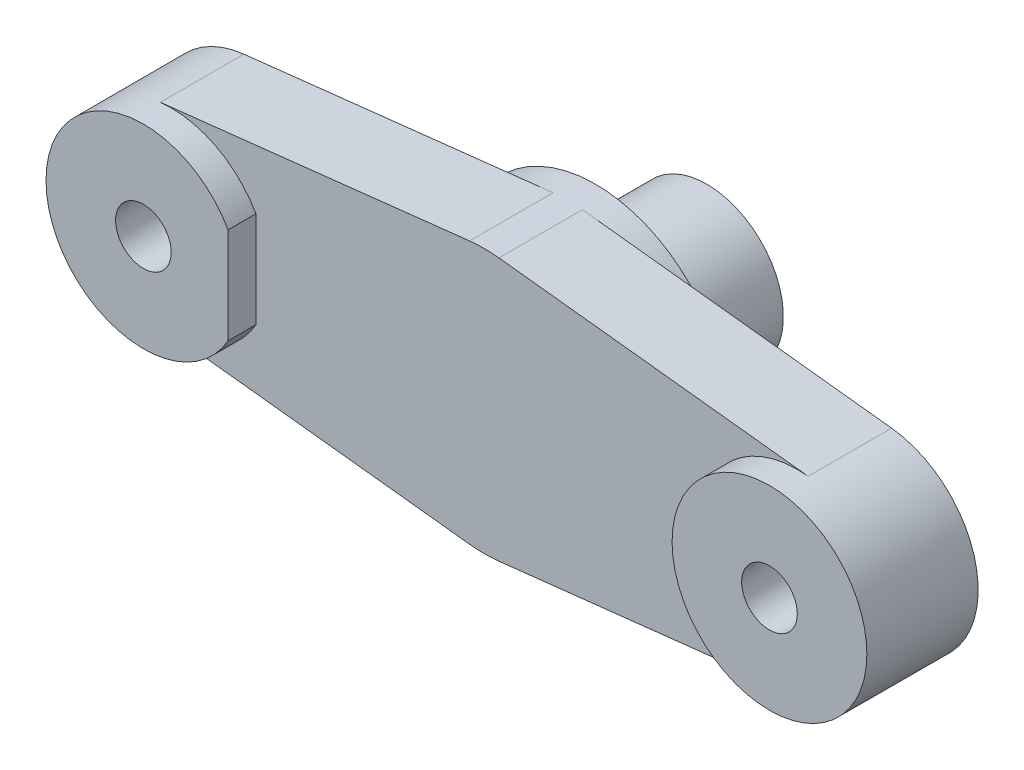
ISO-10303-21;
HEADER;
FILE_DESCRIPTION(('STEP AP214'),'2;1');
FILE_NAME('part.step','',(''),(''),'','','');
FILE_SCHEMA(('AUTOMOTIVE_DESIGN { 1 0 10303 214 1 1 1 1 }'));
ENDSEC;
DATA;
#1=APPLICATION_CONTEXT('core data for automotive mechanical design processes');
#2=APPLICATION_PROTOCOL_DEFINITION('international standard','automotive_design',2000,#1);
#3=PRODUCT_CONTEXT('',#1,'mechanical');
#4=PRODUCT('Part','Part','',(#3));
#5=PRODUCT_RELATED_PRODUCT_CATEGORY('part','',(#4));
#6=PRODUCT_DEFINITION_FORMATION('','',#4);
#7=PRODUCT_DEFINITION_CONTEXT('part definition',#1,'design');
#8=PRODUCT_DEFINITION('design','',#6,#7);
#9=PRODUCT_DEFINITION_SHAPE('','',#8);
#10=(LENGTH_UNIT() NAMED_UNIT(*) SI_UNIT(.MILLI.,.METRE.));
#11=(NAMED_UNIT(*) PLANE_ANGLE_UNIT() SI_UNIT($,.RADIAN.));
#12=(NAMED_UNIT(*) SI_UNIT($,.STERADIAN.) SOLID_ANGLE_UNIT());
#13=UNCERTAINTY_MEASURE_WITH_UNIT(LENGTH_MEASURE(1.E-05),#10,'distance_accuracy_value','');
#14=(GEOMETRIC_REPRESENTATION_CONTEXT(3) GLOBAL_UNCERTAINTY_ASSIGNED_CONTEXT((#13)) GLOBAL_UNIT_ASSIGNED_CONTEXT((#10,
#11,#12)) REPRESENTATION_CONTEXT('',''));
#15=CARTESIAN_POINT('',(0.,0.,0.));
#16=DIRECTION('',(0.,0.,1.));
#17=DIRECTION('',(1.,0.,0.));
#18=AXIS2_PLACEMENT_3D('',#15,#16,#17);
#19=CARTESIAN_POINT('',(-45.,0.,-20.));
#20=DIRECTION('',(0.,0.,1.));
#21=DIRECTION('',(1.,0.,0.));
#22=AXIS2_PLACEMENT_3D('',#19,#20,#21);
#23=CYLINDRICAL_SURFACE('',#22,4.00000000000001);
#24=CARTESIAN_POINT('',(-45.,0.,16.));
#25=DIRECTION('',(0.,0.,1.));
#26=DIRECTION('',(1.,0.,0.));
#27=AXIS2_PLACEMENT_3D('',#24,#25,#26);
#28=CIRCLE('',#27,4.00000000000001);
#29=CARTESIAN_POINT('',(-41.,0.,16.));
#30=VERTEX_POINT('',#29);
#31=EDGE_CURVE('E180',#30,#30,#28,.T.);
#32=ORIENTED_EDGE('',*,*,#31,.T.);
#33=EDGE_LOOP('',(#32));
#34=FACE_BOUND('',#33,.T.);
#35=CARTESIAN_POINT('',(-45.,0.,8.00000000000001));
#36=DIRECTION('',(0.,0.,-1.));
#37=DIRECTION('',(-1.,0.,0.));
#38=AXIS2_PLACEMENT_3D('',#35,#36,#37);
#39=CIRCLE('',#38,4.00000000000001);
#40=CARTESIAN_POINT('',(-49.,0.,8.00000000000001));
#41=VERTEX_POINT('',#40);
#42=EDGE_CURVE('E34',#41,#41,#39,.F.);
#43=ORIENTED_EDGE('',*,*,#42,.F.);
#44=EDGE_LOOP('',(#43));
#45=FACE_BOUND('',#44,.T.);
#46=ADVANCED_FACE('F30',(#34,#45),#23,.F.);
#47=CARTESIAN_POINT('',(45.,0.,-20.));
#48=DIRECTION('',(0.,0.,1.));
#49=DIRECTION('',(1.,0.,0.));
#50=AXIS2_PLACEMENT_3D('',#47,#48,#49);
#51=CYLINDRICAL_SURFACE('',#50,4.00000000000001);
#52=CARTESIAN_POINT('',(45.,0.,16.));
#53=DIRECTION('',(0.,0.,1.));
#54=DIRECTION('',(1.,0.,0.));
#55=AXIS2_PLACEMENT_3D('',#52,#53,#54);
#56=CIRCLE('',#55,4.00000000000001);
#57=CARTESIAN_POINT('',(49.,0.,16.));
#58=VERTEX_POINT('',#57);
#59=EDGE_CURVE('E175',#58,#58,#56,.T.);
#60=ORIENTED_EDGE('',*,*,#59,.T.);
#61=EDGE_LOOP('',(#60));
#62=FACE_BOUND('',#61,.T.);
#63=CARTESIAN_POINT('',(45.,0.,8.00000000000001));
#64=DIRECTION('',(0.,0.,-1.));
#65=DIRECTION('',(-1.,0.,0.));
#66=AXIS2_PLACEMENT_3D('',#63,#64,#65);
#67=CIRCLE('',#66,4.00000000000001);
#68=CARTESIAN_POINT('',(41.,0.,8.00000000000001));
#69=VERTEX_POINT('',#68);
#70=EDGE_CURVE('E173',#69,#69,#67,.F.);
#71=ORIENTED_EDGE('',*,*,#70,.F.);
#72=EDGE_LOOP('',(#71));
#73=FACE_BOUND('',#72,.T.);
#74=ADVANCED_FACE('F284',(#62,#73),#51,.F.);
#75=CARTESIAN_POINT('',(0.,0.,-4.));
#76=DIRECTION('',(0.,0.,-1.));
#77=DIRECTION('',(-1.,0.,0.));
#78=AXIS2_PLACEMENT_3D('',#75,#76,#77);
#79=PLANE('',#78);
#80=CARTESIAN_POINT('',(0.,0.,-4.));
#81=DIRECTION('',(0.,0.,-1.));
#82=DIRECTION('',(-1.,0.,0.));
#83=AXIS2_PLACEMENT_3D('',#80,#81,#82);
#84=CIRCLE('',#83,19.);
#85=CARTESIAN_POINT('',(-19.,0.,-4.));
#86=VERTEX_POINT('',#85);
#87=EDGE_CURVE('E199',#86,#86,#84,.T.);
#88=ORIENTED_EDGE('',*,*,#87,.T.);
#89=EDGE_LOOP('',(#88));
#90=FACE_BOUND('',#89,.T.);
#91=CARTESIAN_POINT('',(0.,0.,-4.));
#92=DIRECTION('',(0.,0.,-1.));
#93=DIRECTION('',(-1.,0.,0.));
#94=AXIS2_PLACEMENT_3D('',#91,#92,#93);
#95=CIRCLE('',#94,11.);
#96=CARTESIAN_POINT('',(-11.,0.,-4.));
#97=VERTEX_POINT('',#96);
#98=EDGE_CURVE('E193',#97,#97,#95,.T.);
#99=ORIENTED_EDGE('',*,*,#98,.F.);
#100=EDGE_LOOP('',(#99));
#101=FACE_BOUND('',#100,.T.);
#102=ADVANCED_FACE('F290',(#90,#101),#79,.T.);
#103=CARTESIAN_POINT('',(0.,0.,0.));
#104=DIRECTION('',(0.,0.,1.));
#105=DIRECTION('',(1.,0.,0.));
#106=AXIS2_PLACEMENT_3D('',#103,#104,#105);
#107=PLANE('',#106);
#108=CARTESIAN_POINT('',(45.,0.,0.));
#109=DIRECTION('',(0.,0.,-1.));
#110=DIRECTION('',(-1.,0.,0.));
#111=AXIS2_PLACEMENT_3D('',#108,#109,#110);
#112=CIRCLE('',#111,7.5);
#113=CARTESIAN_POINT('',(37.5,0.,0.));
#114=VERTEX_POINT('',#113);
#115=EDGE_CURVE('E183',#114,#114,#112,.T.);
#116=ORIENTED_EDGE('',*,*,#115,.F.);
#117=EDGE_LOOP('',(#116));
#118=FACE_BOUND('',#117,.T.);
#119=CARTESIAN_POINT('',(0.,0.,0.));
#120=DIRECTION('',(0.,0.,-1.));
#121=DIRECTION('',(-1.,0.,0.));
#122=AXIS2_PLACEMENT_3D('',#119,#120,#121);
#123=CIRCLE('',#122,19.);
#124=CARTESIAN_POINT('',(2.11111111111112,18.8823518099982,0.));
#125=VERTEX_POINT('',#124);
#126=CARTESIAN_POINT('',(2.11111111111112,-18.8823518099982,0.));
#127=VERTEX_POINT('',#126);
#128=EDGE_CURVE('E11',#125,#127,#123,.T.);
#129=ORIENTED_EDGE('',*,*,#128,.F.);
#130=DIRECTION('',(-0.993807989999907,0.111111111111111,0.));
#131=VECTOR('',#130,1.);
#132=CARTESIAN_POINT('',(2.11111111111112,18.8823518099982,0.));
#133=LINE('',#132,#131);
#134=CARTESIAN_POINT('',(46.5555555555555,13.9133118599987,0.));
#135=VERTEX_POINT('',#134);
#136=EDGE_CURVE('E162',#135,#125,#133,.T.);
#137=ORIENTED_EDGE('',*,*,#136,.F.);
#138=CARTESIAN_POINT('',(45.,0.,0.));
#139=DIRECTION('',(0.,0.,1.));
#140=DIRECTION('',(1.,0.,0.));
#141=AXIS2_PLACEMENT_3D('',#138,#139,#140);
#142=CIRCLE('',#141,14.);
#143=CARTESIAN_POINT('',(46.5555555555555,-13.9133118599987,0.));
#144=VERTEX_POINT('',#143);
#145=EDGE_CURVE('E159',#144,#135,#142,.T.);
#146=ORIENTED_EDGE('',*,*,#145,.F.);
#147=DIRECTION('',(0.993807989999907,0.111111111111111,0.));
#148=VECTOR('',#147,1.);
#149=CARTESIAN_POINT('',(2.11111111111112,-18.8823518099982,0.));
#150=LINE('',#149,#148);
#151=EDGE_CURVE('E157',#127,#144,#150,.T.);
#152=ORIENTED_EDGE('',*,*,#151,.F.);
#153=EDGE_LOOP('',(#129,#137,#146,#152));
#154=FACE_BOUND('',#153,.T.);
#155=ADVANCED_FACE('F251',(#118,#154),#107,.F.);
#156=CARTESIAN_POINT('',(-45.,0.,0.));
#157=DIRECTION('',(0.,0.,-1.));
#158=DIRECTION('',(-1.,0.,0.));
#159=AXIS2_PLACEMENT_3D('',#156,#157,#158);
#160=CIRCLE('',#159,7.5);
#161=CARTESIAN_POINT('',(-52.5,0.,0.));
#162=VERTEX_POINT('',#161);
#163=EDGE_CURVE('E487',#162,#162,#160,.T.);
#164=ORIENTED_EDGE('',*,*,#163,.F.);
#165=EDGE_LOOP('',(#164));
#166=FACE_BOUND('',#165,.T.);
#167=CARTESIAN_POINT('',(-2.11111111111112,-18.8823518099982,0.));
#168=VERTEX_POINT('',#167);
#169=CARTESIAN_POINT('',(-2.11111111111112,18.8823518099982,0.));
#170=VERTEX_POINT('',#169);
#171=EDGE_CURVE('E39',#168,#170,#123,.T.);
#172=ORIENTED_EDGE('',*,*,#171,.F.);
#173=DIRECTION('',(0.993807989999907,-0.111111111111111,0.));
#174=VECTOR('',#173,1.);
#175=CARTESIAN_POINT('',(-46.5555555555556,-13.9133118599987,0.));
#176=LINE('',#175,#174);
#177=CARTESIAN_POINT('',(-46.5555555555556,-13.9133118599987,0.));
#178=VERTEX_POINT('',#177);
#179=EDGE_CURVE('E142',#178,#168,#176,.T.);
#180=ORIENTED_EDGE('',*,*,#179,.F.);
#181=CARTESIAN_POINT('',(-45.,0.,0.));
#182=DIRECTION('',(0.,0.,1.));
#183=DIRECTION('',(1.,0.,0.));
#184=AXIS2_PLACEMENT_3D('',#181,#182,#183);
#185=CIRCLE('',#184,14.);
#186=CARTESIAN_POINT('',(-46.5555555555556,13.9133118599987,0.));
#187=VERTEX_POINT('',#186);
#188=EDGE_CURVE('E127',#187,#178,#185,.T.);
#189=ORIENTED_EDGE('',*,*,#188,.F.);
#190=DIRECTION('',(-0.993807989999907,-0.111111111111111,0.));
#191=VECTOR('',#190,1.);
#192=CARTESIAN_POINT('',(-46.5555555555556,13.9133118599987,0.));
#193=LINE('',#192,#191);
#194=EDGE_CURVE('E112',#170,#187,#193,.T.);
#195=ORIENTED_EDGE('',*,*,#194,.F.);
#196=EDGE_LOOP('',(#172,#180,#189,#195));
#197=FACE_BOUND('',#196,.T.);
#198=ADVANCED_FACE('F124',(#166,#197),#107,.F.);
#199=CARTESIAN_POINT('',(0.,0.,12.));
#200=DIRECTION('',(0.,0.,1.));
#201=DIRECTION('',(1.,0.,0.));
#202=AXIS2_PLACEMENT_3D('',#199,#200,#201);
#203=PLANE('',#202);
#204=DIRECTION('',(0.,1.,0.));
#205=VECTOR('',#204,1.);
#206=CARTESIAN_POINT('',(-32.8206654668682,6.90389819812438,12.));
#207=LINE('',#206,#205);
#208=CARTESIAN_POINT('',(-32.8206654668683,-6.90389819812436,12.));
#209=VERTEX_POINT('',#208);
#210=CARTESIAN_POINT('',(-32.8206654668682,6.90389819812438,12.));
#211=VERTEX_POINT('',#210);
#212=EDGE_CURVE('E204',#209,#211,#207,.T.);
#213=ORIENTED_EDGE('',*,*,#212,.F.);
#214=CARTESIAN_POINT('',(-45.,0.,12.));
#215=DIRECTION('',(0.,0.,1.));
#216=DIRECTION('',(1.,0.,0.));
#217=AXIS2_PLACEMENT_3D('',#214,#215,#216);
#218=CIRCLE('',#217,14.);
#219=CARTESIAN_POINT('',(-46.5555555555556,-13.9133118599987,12.));
#220=VERTEX_POINT('',#219);
#221=EDGE_CURVE('E119',#209,#220,#218,.F.);
#222=ORIENTED_EDGE('',*,*,#221,.T.);
#223=DIRECTION('',(0.993807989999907,-0.111111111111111,0.));
#224=VECTOR('',#223,1.);
#225=CARTESIAN_POINT('',(-46.5555555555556,-13.9133118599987,12.));
#226=LINE('',#225,#224);
#227=CARTESIAN_POINT('',(-2.11111111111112,-18.8823518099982,12.));
#228=VERTEX_POINT('',#227);
#229=EDGE_CURVE('E255',#220,#228,#226,.T.);
#230=ORIENTED_EDGE('',*,*,#229,.T.);
#231=CARTESIAN_POINT('',(0.,0.,12.));
#232=DIRECTION('',(0.,0.,1.));
#233=DIRECTION('',(1.,0.,0.));
#234=AXIS2_PLACEMENT_3D('',#231,#232,#233);
#235=CIRCLE('',#234,19.);
#236=CARTESIAN_POINT('',(2.11111111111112,-18.8823518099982,12.));
#237=VERTEX_POINT('',#236);
#238=EDGE_CURVE('E235',#228,#237,#235,.T.);
#239=ORIENTED_EDGE('',*,*,#238,.T.);
#240=DIRECTION('',(0.993807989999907,0.111111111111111,0.));
#241=VECTOR('',#240,1.);
#242=CARTESIAN_POINT('',(2.11111111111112,-18.8823518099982,12.));
#243=LINE('',#242,#241);
#244=CARTESIAN_POINT('',(46.5555555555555,-13.9133118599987,12.));
#245=VERTEX_POINT('',#244);
#246=EDGE_CURVE('E227',#237,#245,#243,.T.);
#247=ORIENTED_EDGE('',*,*,#246,.T.);
#248=CARTESIAN_POINT('',(45.,0.,12.));
#249=DIRECTION('',(0.,0.,1.));
#250=DIRECTION('',(1.,0.,0.));
#251=AXIS2_PLACEMENT_3D('',#248,#249,#250);
#252=CIRCLE('',#251,14.);
#253=CARTESIAN_POINT('',(46.5555555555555,13.9133118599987,12.));
#254=VERTEX_POINT('',#253);
#255=EDGE_CURVE('E215',#254,#245,#252,.T.);
#256=ORIENTED_EDGE('',*,*,#255,.F.);
#257=DIRECTION('',(-0.993807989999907,0.111111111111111,0.));
#258=VECTOR('',#257,1.);
#259=CARTESIAN_POINT('',(2.11111111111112,18.8823518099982,12.));
#260=LINE('',#259,#258);
#261=CARTESIAN_POINT('',(2.11111111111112,18.8823518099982,12.));
#262=VERTEX_POINT('',#261);
#263=EDGE_CURVE('E55',#254,#262,#260,.T.);
#264=ORIENTED_EDGE('',*,*,#263,.T.);
#265=CARTESIAN_POINT('',(0.,0.,12.));
#266=DIRECTION('',(0.,0.,1.));
#267=DIRECTION('',(1.,0.,0.));
#268=AXIS2_PLACEMENT_3D('',#265,#266,#267);
#269=CIRCLE('',#268,19.);
#270=CARTESIAN_POINT('',(-2.11111111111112,18.8823518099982,12.));
#271=VERTEX_POINT('',#270);
#272=EDGE_CURVE('E165',#262,#271,#269,.T.);
#273=ORIENTED_EDGE('',*,*,#272,.T.);
#274=DIRECTION('',(-0.993807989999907,-0.111111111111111,0.));
#275=VECTOR('',#274,1.);
#276=CARTESIAN_POINT('',(-46.5555555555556,13.9133118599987,12.));
#277=LINE('',#276,#275);
#278=CARTESIAN_POINT('',(-46.5555555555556,13.9133118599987,12.));
#279=VERTEX_POINT('',#278);
#280=EDGE_CURVE('E115',#271,#279,#277,.T.);
#281=ORIENTED_EDGE('',*,*,#280,.T.);
#282=CARTESIAN_POINT('',(-45.,0.,12.));
#283=DIRECTION('',(0.,0.,1.));
#284=DIRECTION('',(1.,0.,0.));
#285=AXIS2_PLACEMENT_3D('',#282,#283,#284);
#286=CIRCLE('',#285,14.);
#287=EDGE_CURVE('E202',#211,#279,#286,.T.);
#288=ORIENTED_EDGE('',*,*,#287,.F.);
#289=EDGE_LOOP('',(#213,#222,#230,#239,#247,#256,#264,#273,#281,#288));
#290=FACE_BOUND('',#289,.T.);
#291=ADVANCED_FACE('F269',(#290),#203,.T.);
#292=CARTESIAN_POINT('',(-46.5555555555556,13.9133118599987,12.));
#293=DIRECTION('',(0.111111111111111,-0.993807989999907,0.));
#294=DIRECTION('',(0.993807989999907,0.111111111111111,0.));
#295=AXIS2_PLACEMENT_3D('',#292,#293,#294);
#296=PLANE('',#295);
#297=ORIENTED_EDGE('',*,*,#194,.T.);
#298=DIRECTION('',(0.,0.,-1.));
#299=VECTOR('',#298,1.);
#300=CARTESIAN_POINT('',(-46.5555555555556,13.9133118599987,12.));
#301=LINE('',#300,#299);
#302=EDGE_CURVE('E120',#279,#187,#301,.T.);
#303=ORIENTED_EDGE('',*,*,#302,.F.);
#304=ORIENTED_EDGE('',*,*,#280,.F.);
#305=DIRECTION('',(0.,0.,-1.));
#306=VECTOR('',#305,1.);
#307=CARTESIAN_POINT('',(-2.11111111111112,18.8823518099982,12.));
#308=LINE('',#307,#306);
#309=EDGE_CURVE('E109',#271,#170,#308,.T.);
#310=ORIENTED_EDGE('',*,*,#309,.T.);
#311=EDGE_LOOP('',(#297,#303,#304,#310));
#312=FACE_BOUND('',#311,.T.);
#313=ADVANCED_FACE('F32',(#312),#296,.F.);
#314=CARTESIAN_POINT('',(-45.,0.,12.));
#315=DIRECTION('',(0.,0.,-1.));
#316=DIRECTION('',(-1.,0.,0.));
#317=AXIS2_PLACEMENT_3D('',#314,#315,#316);
#318=CYLINDRICAL_SURFACE('',#317,14.);
#319=ORIENTED_EDGE('',*,*,#188,.T.);
#320=DIRECTION('',(0.,0.,-1.));
#321=VECTOR('',#320,1.);
#322=CARTESIAN_POINT('',(-46.5555555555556,-13.9133118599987,12.));
#323=LINE('',#322,#321);
#324=EDGE_CURVE('E257',#220,#178,#323,.T.);
#325=ORIENTED_EDGE('',*,*,#324,.F.);
#326=ORIENTED_EDGE('',*,*,#221,.F.);
#327=DIRECTION('',(0.,0.,-1.));
#328=VECTOR('',#327,1.);
#329=CARTESIAN_POINT('',(-32.8206654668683,-6.90389819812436,16.));
#330=LINE('',#329,#328);
#331=CARTESIAN_POINT('',(-32.8206654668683,-6.90389819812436,16.));
#332=VERTEX_POINT('',#331);
#333=EDGE_CURVE('E47',#332,#209,#330,.T.);
#334=ORIENTED_EDGE('',*,*,#333,.F.);
#335=CARTESIAN_POINT('',(-45.,0.,16.));
#336=DIRECTION('',(0.,0.,1.));
#337=DIRECTION('',(1.,0.,0.));
#338=AXIS2_PLACEMENT_3D('',#335,#336,#337);
#339=CIRCLE('',#338,14.);
#340=CARTESIAN_POINT('',(-32.8206654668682,6.90389819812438,16.));
#341=VERTEX_POINT('',#340);
#342=EDGE_CURVE('E206',#341,#332,#339,.T.);
#343=ORIENTED_EDGE('',*,*,#342,.F.);
#344=DIRECTION('',(0.,0.,-1.));
#345=VECTOR('',#344,1.);
#346=CARTESIAN_POINT('',(-32.8206654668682,6.90389819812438,16.));
#347=LINE('',#346,#345);
#348=EDGE_CURVE('E211',#341,#211,#347,.T.);
#349=ORIENTED_EDGE('',*,*,#348,.T.);
#350=ORIENTED_EDGE('',*,*,#287,.T.);
#351=ORIENTED_EDGE('',*,*,#302,.T.);
#352=EDGE_LOOP('',(#319,#325,#326,#334,#343,#349,#350,#351));
#353=FACE_BOUND('',#352,.T.);
#354=ADVANCED_FACE('F264',(#353),#318,.T.);
#355=CARTESIAN_POINT('',(-46.5555555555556,-13.9133118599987,12.));
#356=DIRECTION('',(0.111111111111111,0.993807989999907,0.));
#357=DIRECTION('',(-0.993807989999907,0.111111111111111,0.));
#358=AXIS2_PLACEMENT_3D('',#355,#356,#357);
#359=PLANE('',#358);
#360=ORIENTED_EDGE('',*,*,#179,.T.);
#361=DIRECTION('',(0.,0.,-1.));
#362=VECTOR('',#361,1.);
#363=CARTESIAN_POINT('',(-2.11111111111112,-18.8823518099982,12.));
#364=LINE('',#363,#362);
#365=EDGE_CURVE('E135',#228,#168,#364,.T.);
#366=ORIENTED_EDGE('',*,*,#365,.F.);
#367=ORIENTED_EDGE('',*,*,#229,.F.);
#368=ORIENTED_EDGE('',*,*,#324,.T.);
#369=EDGE_LOOP('',(#360,#366,#367,#368));
#370=FACE_BOUND('',#369,.T.);
#371=ADVANCED_FACE('F281',(#370),#359,.F.);
#372=CARTESIAN_POINT('',(0.,0.,12.));
#373=DIRECTION('',(0.,0.,-1.));
#374=DIRECTION('',(-1.,0.,0.));
#375=AXIS2_PLACEMENT_3D('',#372,#373,#374);
#376=CYLINDRICAL_SURFACE('',#375,19.);
#377=ORIENTED_EDGE('',*,*,#365,.T.);
#378=ORIENTED_EDGE('',*,*,#171,.T.);
#379=ORIENTED_EDGE('',*,*,#309,.F.);
#380=ORIENTED_EDGE('',*,*,#272,.F.);
#381=DIRECTION('',(0.,0.,-1.));
#382=VECTOR('',#381,1.);
#383=CARTESIAN_POINT('',(2.11111111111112,18.8823518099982,12.));
#384=LINE('',#383,#382);
#385=EDGE_CURVE('E168',#262,#125,#384,.T.);
#386=ORIENTED_EDGE('',*,*,#385,.T.);
#387=ORIENTED_EDGE('',*,*,#128,.T.);
#388=DIRECTION('',(0.,0.,-1.));
#389=VECTOR('',#388,1.);
#390=CARTESIAN_POINT('',(2.11111111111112,-18.8823518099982,12.));
#391=LINE('',#390,#389);
#392=EDGE_CURVE('E152',#237,#127,#391,.T.);
#393=ORIENTED_EDGE('',*,*,#392,.F.);
#394=ORIENTED_EDGE('',*,*,#238,.F.);
#395=EDGE_LOOP('',(#377,#378,#379,#380,#386,#387,#393,#394));
#396=FACE_BOUND('',#395,.T.);
#397=ORIENTED_EDGE('',*,*,#87,.F.);
#398=EDGE_LOOP('',(#397));
#399=FACE_BOUND('',#398,.T.);
#400=ADVANCED_FACE('F131',(#396,#399),#376,.T.);
#401=CARTESIAN_POINT('',(2.11111111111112,-18.8823518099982,12.));
#402=DIRECTION('',(-0.111111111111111,0.993807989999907,0.));
#403=DIRECTION('',(-0.993807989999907,-0.111111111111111,0.));
#404=AXIS2_PLACEMENT_3D('',#401,#402,#403);
#405=PLANE('',#404);
#406=ORIENTED_EDGE('',*,*,#151,.T.);
#407=DIRECTION('',(0.,0.,-1.));
#408=VECTOR('',#407,1.);
#409=CARTESIAN_POINT('',(46.5555555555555,-13.9133118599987,12.));
#410=LINE('',#409,#408);
#411=EDGE_CURVE('E154',#245,#144,#410,.T.);
#412=ORIENTED_EDGE('',*,*,#411,.F.);
#413=ORIENTED_EDGE('',*,*,#246,.F.);
#414=ORIENTED_EDGE('',*,*,#392,.T.);
#415=EDGE_LOOP('',(#406,#412,#413,#414));
#416=FACE_BOUND('',#415,.T.);
#417=ADVANCED_FACE('F273',(#416),#405,.F.);
#418=CARTESIAN_POINT('',(45.,0.,12.));
#419=DIRECTION('',(0.,0.,-1.));
#420=DIRECTION('',(-1.,0.,0.));
#421=AXIS2_PLACEMENT_3D('',#418,#419,#420);
#422=CYLINDRICAL_SURFACE('',#421,14.);
#423=ORIENTED_EDGE('',*,*,#145,.T.);
#424=DIRECTION('',(0.,0.,-1.));
#425=VECTOR('',#424,1.);
#426=CARTESIAN_POINT('',(46.5555555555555,13.9133118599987,12.));
#427=LINE('',#426,#425);
#428=EDGE_CURVE('E171',#254,#135,#427,.T.);
#429=ORIENTED_EDGE('',*,*,#428,.F.);
#430=ORIENTED_EDGE('',*,*,#255,.T.);
#431=ORIENTED_EDGE('',*,*,#411,.T.);
#432=EDGE_LOOP('',(#423,#429,#430,#431));
#433=FACE_BOUND('',#432,.T.);
#434=CARTESIAN_POINT('',(45.,0.,16.));
#435=DIRECTION('',(0.,0.,1.));
#436=DIRECTION('',(1.,0.,0.));
#437=AXIS2_PLACEMENT_3D('',#434,#435,#436);
#438=CIRCLE('',#437,14.);
#439=CARTESIAN_POINT('',(59.,0.,16.));
#440=VERTEX_POINT('',#439);
#441=EDGE_CURVE('E128',#440,#440,#438,.T.);
#442=ORIENTED_EDGE('',*,*,#441,.F.);
#443=EDGE_LOOP('',(#442));
#444=FACE_BOUND('',#443,.T.);
#445=ADVANCED_FACE('F243',(#433,#444),#422,.T.);
#446=CARTESIAN_POINT('',(2.11111111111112,18.8823518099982,12.));
#447=DIRECTION('',(-0.111111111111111,-0.993807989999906,0.));
#448=DIRECTION('',(0.993807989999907,-0.111111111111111,0.));
#449=AXIS2_PLACEMENT_3D('',#446,#447,#448);
#450=PLANE('',#449);
#451=ORIENTED_EDGE('',*,*,#136,.T.);
#452=ORIENTED_EDGE('',*,*,#385,.F.);
#453=ORIENTED_EDGE('',*,*,#263,.F.);
#454=ORIENTED_EDGE('',*,*,#428,.T.);
#455=EDGE_LOOP('',(#451,#452,#453,#454));
#456=FACE_BOUND('',#455,.T.);
#457=ADVANCED_FACE('F272',(#456),#450,.F.);
#458=CARTESIAN_POINT('',(45.,0.,16.));
#459=DIRECTION('',(0.,0.,1.));
#460=DIRECTION('',(1.,0.,0.));
#461=AXIS2_PLACEMENT_3D('',#458,#459,#460);
#462=PLANE('',#461);
#463=ORIENTED_EDGE('',*,*,#59,.F.);
#464=EDGE_LOOP('',(#463));
#465=FACE_BOUND('',#464,.T.);
#466=ORIENTED_EDGE('',*,*,#441,.T.);
#467=EDGE_LOOP('',(#466));
#468=FACE_BOUND('',#467,.T.);
#469=ADVANCED_FACE('F315',(#465,#468),#462,.T.);
#470=CARTESIAN_POINT('',(-32.8206654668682,6.90389819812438,16.));
#471=DIRECTION('',(-1.,0.,0.));
#472=DIRECTION('',(0.,0.,1.));
#473=AXIS2_PLACEMENT_3D('',#470,#471,#472);
#474=PLANE('',#473);
#475=ORIENTED_EDGE('',*,*,#212,.T.);
#476=ORIENTED_EDGE('',*,*,#348,.F.);
#477=DIRECTION('',(0.,1.,0.));
#478=VECTOR('',#477,1.);
#479=CARTESIAN_POINT('',(-32.8206654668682,6.90389819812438,16.));
#480=LINE('',#479,#478);
#481=EDGE_CURVE('E209',#332,#341,#480,.T.);
#482=ORIENTED_EDGE('',*,*,#481,.F.);
#483=ORIENTED_EDGE('',*,*,#333,.T.);
#484=EDGE_LOOP('',(#475,#476,#482,#483));
#485=FACE_BOUND('',#484,.T.);
#486=ADVANCED_FACE('F311',(#485),#474,.F.);
#487=CARTESIAN_POINT('',(-45.,0.,16.));
#488=DIRECTION('',(0.,0.,1.));
#489=DIRECTION('',(1.,0.,0.));
#490=AXIS2_PLACEMENT_3D('',#487,#488,#489);
#491=PLANE('',#490);
#492=ORIENTED_EDGE('',*,*,#31,.F.);
#493=EDGE_LOOP('',(#492));
#494=FACE_BOUND('',#493,.T.);
#495=ORIENTED_EDGE('',*,*,#342,.T.);
#496=ORIENTED_EDGE('',*,*,#481,.T.);
#497=EDGE_LOOP('',(#495,#496));
#498=FACE_BOUND('',#497,.T.);
#499=ADVANCED_FACE('F304',(#494,#498),#491,.T.);
#500=CARTESIAN_POINT('',(0.,0.,-20.));
#501=DIRECTION('',(0.,0.,1.));
#502=DIRECTION('',(1.,0.,0.));
#503=AXIS2_PLACEMENT_3D('',#500,#501,#502);
#504=CYLINDRICAL_SURFACE('',#503,11.);
#505=CARTESIAN_POINT('',(0.,0.,-20.));
#506=DIRECTION('',(0.,0.,-1.));
#507=DIRECTION('',(-1.,0.,0.));
#508=AXIS2_PLACEMENT_3D('',#505,#506,#507);
#509=CIRCLE('',#508,11.);
#510=CARTESIAN_POINT('',(-11.,0.,-20.));
#511=VERTEX_POINT('',#510);
#512=EDGE_CURVE('E196',#511,#511,#509,.T.);
#513=ORIENTED_EDGE('',*,*,#512,.F.);
#514=EDGE_LOOP('',(#513));
#515=FACE_BOUND('',#514,.T.);
#516=ORIENTED_EDGE('',*,*,#98,.T.);
#517=EDGE_LOOP('',(#516));
#518=FACE_BOUND('',#517,.T.);
#519=ADVANCED_FACE('F300',(#515,#518),#504,.T.);
#520=CARTESIAN_POINT('',(0.,0.,-20.));
#521=DIRECTION('',(0.,0.,-1.));
#522=DIRECTION('',(-1.,0.,0.));
#523=AXIS2_PLACEMENT_3D('',#520,#521,#522);
#524=PLANE('',#523);
#525=ORIENTED_EDGE('',*,*,#512,.T.);
#526=EDGE_LOOP('',(#525));
#527=FACE_BOUND('',#526,.T.);
#528=ADVANCED_FACE('F296',(#527),#524,.T.);
#529=CARTESIAN_POINT('',(45.,0.,8.00000000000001));
#530=DIRECTION('',(0.,0.,-1.));
#531=DIRECTION('',(-1.,0.,0.));
#532=AXIS2_PLACEMENT_3D('',#529,#530,#531);
#533=PLANE('',#532);
#534=CARTESIAN_POINT('',(45.,0.,8.00000000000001));
#535=DIRECTION('',(0.,0.,-1.));
#536=DIRECTION('',(-1.,0.,0.));
#537=AXIS2_PLACEMENT_3D('',#534,#535,#536);
#538=CIRCLE('',#537,7.5);
#539=CARTESIAN_POINT('',(37.5,0.,8.00000000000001));
#540=VERTEX_POINT('',#539);
#541=EDGE_CURVE('E176',#540,#540,#538,.T.);
#542=ORIENTED_EDGE('',*,*,#541,.T.);
#543=EDGE_LOOP('',(#542));
#544=FACE_BOUND('',#543,.T.);
#545=ORIENTED_EDGE('',*,*,#70,.T.);
#546=EDGE_LOOP('',(#545));
#547=FACE_BOUND('',#546,.T.);
#548=ADVANCED_FACE('F299',(#544,#547),#533,.T.);
#549=CARTESIAN_POINT('',(45.,0.,8.00000000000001));
#550=DIRECTION('',(0.,0.,-1.));
#551=DIRECTION('',(-1.,0.,0.));
#552=AXIS2_PLACEMENT_3D('',#549,#550,#551);
#553=CYLINDRICAL_SURFACE('',#552,7.5);
#554=ORIENTED_EDGE('',*,*,#541,.F.);
#555=EDGE_LOOP('',(#554));
#556=FACE_BOUND('',#555,.T.);
#557=ORIENTED_EDGE('',*,*,#115,.T.);
#558=EDGE_LOOP('',(#557));
#559=FACE_BOUND('',#558,.T.);
#560=ADVANCED_FACE('F355',(#556,#559),#553,.F.);
#561=CARTESIAN_POINT('',(-45.,0.,8.00000000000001));
#562=DIRECTION('',(0.,0.,-1.));
#563=DIRECTION('',(-1.,0.,0.));
#564=AXIS2_PLACEMENT_3D('',#561,#562,#563);
#565=PLANE('',#564);
#566=CARTESIAN_POINT('',(-45.,0.,8.00000000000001));
#567=DIRECTION('',(0.,0.,-1.));
#568=DIRECTION('',(-1.,0.,0.));
#569=AXIS2_PLACEMENT_3D('',#566,#567,#568);
#570=CIRCLE('',#569,7.5);
#571=CARTESIAN_POINT('',(-52.5,0.,8.00000000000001));
#572=VERTEX_POINT('',#571);
#573=EDGE_CURVE('E489',#572,#572,#570,.T.);
#574=ORIENTED_EDGE('',*,*,#573,.T.);
#575=EDGE_LOOP('',(#574));
#576=FACE_BOUND('',#575,.T.);
#577=ORIENTED_EDGE('',*,*,#42,.T.);
#578=EDGE_LOOP('',(#577));
#579=FACE_BOUND('',#578,.T.);
#580=ADVANCED_FACE('F362',(#576,#579),#565,.T.);
#581=CARTESIAN_POINT('',(-45.,0.,8.00000000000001));
#582=DIRECTION('',(0.,0.,-1.));
#583=DIRECTION('',(-1.,0.,0.));
#584=AXIS2_PLACEMENT_3D('',#581,#582,#583);
#585=CYLINDRICAL_SURFACE('',#584,7.5);
#586=ORIENTED_EDGE('',*,*,#573,.F.);
#587=EDGE_LOOP('',(#586));
#588=FACE_BOUND('',#587,.T.);
#589=ORIENTED_EDGE('',*,*,#163,.T.);
#590=EDGE_LOOP('',(#589));
#591=FACE_BOUND('',#590,.T.);
#592=ADVANCED_FACE('F369',(#588,#591),#585,.F.);
#593=CLOSED_SHELL('',(#46,#74,#102,#155,#198,#291,#313,#354,#371,#400,#417,#445,#457,#469,#486,
#499,#519,#528,#548,#560,#580,#592));
#594=MANIFOLD_SOLID_BREP('B2',#593);
#595=ADVANCED_BREP_SHAPE_REPRESENTATION('',(#18,#594),#14);
#596=SHAPE_DEFINITION_REPRESENTATION(#9,#595);
ENDSEC;
END-ISO-10303-21;
